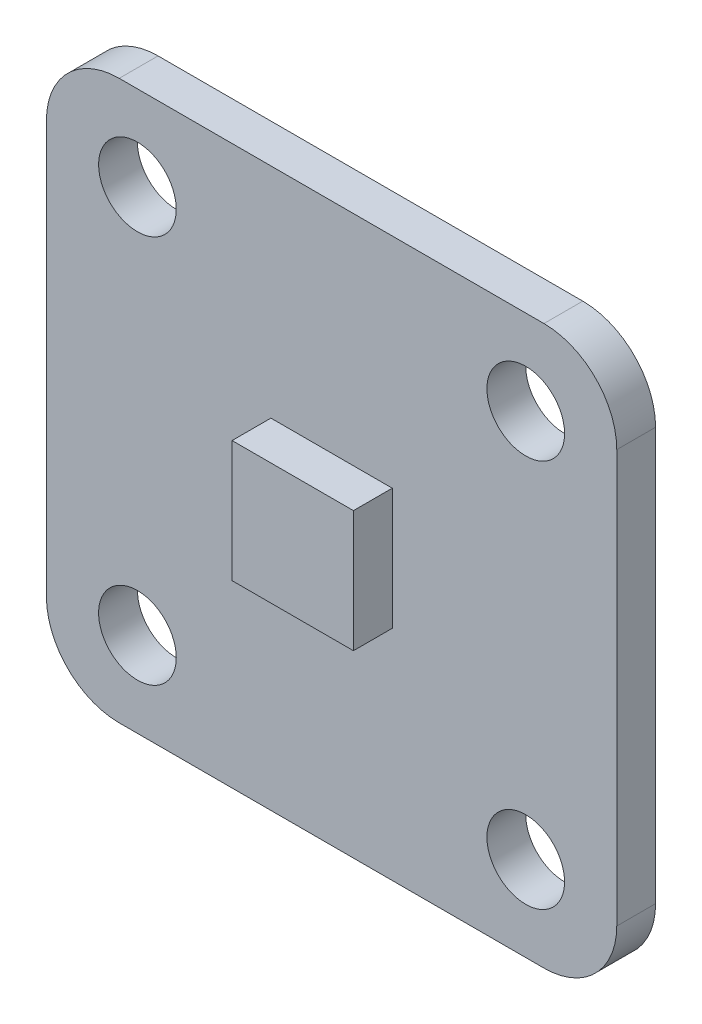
from build123d import *

# Parameters (mm, degrees)
SKICA1_W                = 23.5
SKICA1_H                = 23
SKICA1_R                = 1.6
P_IDAT_VYSUNUT_M1_DEPTH = 1.6
ZAOBLIT1_R              = 3
SKICA2_W                = 5
SKICA2_H                = 5
P_IDAT_VYSUNUT_M2_DEPTH = 1.6


with BuildPart() as part:
    # Skica1 → P_idat vysunut_m1 (new body)
    with BuildSketch(Plane.XY):
        Rectangle(SKICA1_W, SKICA1_H)
        with Locations((8, 8)):
            Circle(SKICA1_R, mode=Mode.SUBTRACT)
        with Locations(Location((8, -8, 0), (0, 0, 180))):
            Circle(SKICA1_R, mode=Mode.SUBTRACT)
        with Locations((-8, -8)):
            Circle(SKICA1_R, mode=Mode.SUBTRACT)
        with Locations(Location((-8, 8, 0), (0, 0, 180))):
            Circle(SKICA1_R, mode=Mode.SUBTRACT)
    extrude(amount=P_IDAT_VYSUNUT_M1_DEPTH)

    # Zaoblit1
    zaoblit1_edges = [part.edges().sort_by_distance(p)[0] for p in [
        (11.75, -11.5, 0.8),
        (-11.75, -11.5, 0.8),
        (-11.75, 11.5, 0.8),
        (11.75, 11.5, 0.8),
    ]]
    fillet(zaoblit1_edges, radius=ZAOBLIT1_R)

    # Skica2 → P_idat vysunut_m2 (add)
    with BuildSketch(Plane.XY.offset(1.6)):
        Rectangle(SKICA2_W, SKICA2_H)
    extrude(amount=P_IDAT_VYSUNUT_M2_DEPTH)


solid = part.part
